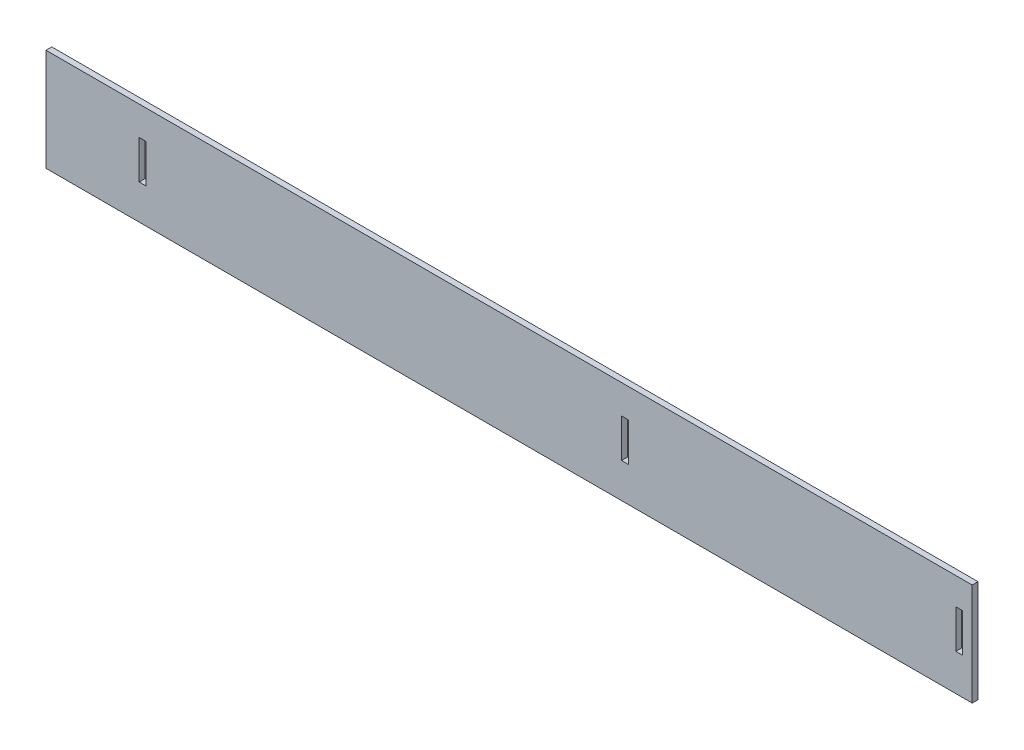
ISO-10303-21;
HEADER;
FILE_DESCRIPTION(('STEP AP214'),'2;1');
FILE_NAME('part.step','',(''),(''),'','','');
FILE_SCHEMA(('AUTOMOTIVE_DESIGN { 1 0 10303 214 1 1 1 1 }'));
ENDSEC;
DATA;
#1=APPLICATION_CONTEXT('core data for automotive mechanical design processes');
#2=APPLICATION_PROTOCOL_DEFINITION('international standard','automotive_design',2000,#1);
#3=PRODUCT_CONTEXT('',#1,'mechanical');
#4=PRODUCT('Part','Part','',(#3));
#5=PRODUCT_RELATED_PRODUCT_CATEGORY('part','',(#4));
#6=PRODUCT_DEFINITION_FORMATION('','',#4);
#7=PRODUCT_DEFINITION_CONTEXT('part definition',#1,'design');
#8=PRODUCT_DEFINITION('design','',#6,#7);
#9=PRODUCT_DEFINITION_SHAPE('','',#8);
#10=(LENGTH_UNIT() NAMED_UNIT(*) SI_UNIT(.MILLI.,.METRE.));
#11=(NAMED_UNIT(*) PLANE_ANGLE_UNIT() SI_UNIT($,.RADIAN.));
#12=(NAMED_UNIT(*) SI_UNIT($,.STERADIAN.) SOLID_ANGLE_UNIT());
#13=UNCERTAINTY_MEASURE_WITH_UNIT(LENGTH_MEASURE(1.E-05),#10,'distance_accuracy_value','');
#14=(GEOMETRIC_REPRESENTATION_CONTEXT(3) GLOBAL_UNCERTAINTY_ASSIGNED_CONTEXT((#13)) GLOBAL_UNIT_ASSIGNED_CONTEXT((#10,
#11,#12)) REPRESENTATION_CONTEXT('',''));
#15=CARTESIAN_POINT('',(0.,0.,0.));
#16=DIRECTION('',(0.,0.,1.));
#17=DIRECTION('',(1.,0.,0.));
#18=AXIS2_PLACEMENT_3D('',#15,#16,#17);
#19=CARTESIAN_POINT('',(0.,0.,3.));
#20=DIRECTION('',(0.,0.,1.));
#21=DIRECTION('',(1.,0.,0.));
#22=AXIS2_PLACEMENT_3D('',#19,#20,#21);
#23=PLANE('',#22);
#24=DIRECTION('',(0.,-1.,0.));
#25=VECTOR('',#24,1.);
#26=CARTESIAN_POINT('',(0.,50.,3.));
#27=LINE('',#26,#25);
#28=CARTESIAN_POINT('',(0.,50.,3.));
#29=VERTEX_POINT('',#28);
#30=CARTESIAN_POINT('',(0.,-3.,3.));
#31=VERTEX_POINT('',#30);
#32=EDGE_CURVE('E244',#29,#31,#27,.T.);
#33=ORIENTED_EDGE('',*,*,#32,.T.);
#34=DIRECTION('',(1.,0.,0.));
#35=VECTOR('',#34,1.);
#36=CARTESIAN_POINT('',(0.,-3.,3.));
#37=LINE('',#36,#35);
#38=CARTESIAN_POINT('',(480.,-3.,3.));
#39=VERTEX_POINT('',#38);
#40=EDGE_CURVE('E246',#31,#39,#37,.T.);
#41=ORIENTED_EDGE('',*,*,#40,.T.);
#42=DIRECTION('',(0.,1.,0.));
#43=VECTOR('',#42,1.);
#44=CARTESIAN_POINT('',(480.,-3.,3.));
#45=LINE('',#44,#43);
#46=CARTESIAN_POINT('',(480.,50.,3.));
#47=VERTEX_POINT('',#46);
#48=EDGE_CURVE('E249',#39,#47,#45,.T.);
#49=ORIENTED_EDGE('',*,*,#48,.T.);
#50=DIRECTION('',(-1.,0.,0.));
#51=VECTOR('',#50,1.);
#52=CARTESIAN_POINT('',(0.,50.,3.));
#53=LINE('',#52,#51);
#54=EDGE_CURVE('E251',#47,#29,#53,.T.);
#55=ORIENTED_EDGE('',*,*,#54,.T.);
#56=EDGE_LOOP('',(#33,#41,#49,#55));
#57=FACE_BOUND('',#56,.T.);
#58=DIRECTION('',(1.,0.,0.));
#59=VECTOR('',#58,1.);
#60=CARTESIAN_POINT('',(48.25,15.,3.));
#61=LINE('',#60,#59);
#62=CARTESIAN_POINT('',(48.25,15.,3.));
#63=VERTEX_POINT('',#62);
#64=CARTESIAN_POINT('',(51.75,15.,3.));
#65=VERTEX_POINT('',#64);
#66=EDGE_CURVE('E215',#63,#65,#61,.T.);
#67=ORIENTED_EDGE('',*,*,#66,.F.);
#68=DIRECTION('',(0.,-1.,0.));
#69=VECTOR('',#68,1.);
#70=CARTESIAN_POINT('',(48.25,35.,3.));
#71=LINE('',#70,#69);
#72=CARTESIAN_POINT('',(48.25,35.,3.));
#73=VERTEX_POINT('',#72);
#74=EDGE_CURVE('E213',#73,#63,#71,.T.);
#75=ORIENTED_EDGE('',*,*,#74,.F.);
#76=DIRECTION('',(-1.,0.,0.));
#77=VECTOR('',#76,1.);
#78=CARTESIAN_POINT('',(48.25,35.,3.));
#79=LINE('',#78,#77);
#80=CARTESIAN_POINT('',(51.75,35.,3.));
#81=VERTEX_POINT('',#80);
#82=EDGE_CURVE('E221',#81,#73,#79,.T.);
#83=ORIENTED_EDGE('',*,*,#82,.F.);
#84=DIRECTION('',(0.,1.,0.));
#85=VECTOR('',#84,1.);
#86=CARTESIAN_POINT('',(51.75,35.,3.));
#87=LINE('',#86,#85);
#88=EDGE_CURVE('E218',#65,#81,#87,.T.);
#89=ORIENTED_EDGE('',*,*,#88,.F.);
#90=EDGE_LOOP('',(#67,#75,#83,#89));
#91=FACE_BOUND('',#90,.T.);
#92=DIRECTION('',(1.,0.,0.));
#93=VECTOR('',#92,1.);
#94=CARTESIAN_POINT('',(298.25,15.,3.));
#95=LINE('',#94,#93);
#96=CARTESIAN_POINT('',(298.25,15.,3.));
#97=VERTEX_POINT('',#96);
#98=CARTESIAN_POINT('',(301.75,15.,3.));
#99=VERTEX_POINT('',#98);
#100=EDGE_CURVE('E184',#97,#99,#95,.T.);
#101=ORIENTED_EDGE('',*,*,#100,.F.);
#102=DIRECTION('',(0.,-1.,0.));
#103=VECTOR('',#102,1.);
#104=CARTESIAN_POINT('',(298.25,35.,3.));
#105=LINE('',#104,#103);
#106=CARTESIAN_POINT('',(298.25,35.,3.));
#107=VERTEX_POINT('',#106);
#108=EDGE_CURVE('E182',#107,#97,#105,.T.);
#109=ORIENTED_EDGE('',*,*,#108,.F.);
#110=DIRECTION('',(-1.,0.,0.));
#111=VECTOR('',#110,1.);
#112=CARTESIAN_POINT('',(298.25,35.,3.));
#113=LINE('',#112,#111);
#114=CARTESIAN_POINT('',(301.75,35.,3.));
#115=VERTEX_POINT('',#114);
#116=EDGE_CURVE('E190',#115,#107,#113,.T.);
#117=ORIENTED_EDGE('',*,*,#116,.F.);
#118=DIRECTION('',(0.,1.,0.));
#119=VECTOR('',#118,1.);
#120=CARTESIAN_POINT('',(301.75,35.,3.));
#121=LINE('',#120,#119);
#122=EDGE_CURVE('E187',#99,#115,#121,.T.);
#123=ORIENTED_EDGE('',*,*,#122,.F.);
#124=EDGE_LOOP('',(#101,#109,#117,#123));
#125=FACE_BOUND('',#124,.T.);
#126=DIRECTION('',(1.,0.,0.));
#127=VECTOR('',#126,1.);
#128=CARTESIAN_POINT('',(471.5,15.9720814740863,3.));
#129=LINE('',#128,#127);
#130=CARTESIAN_POINT('',(471.5,15.9720814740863,3.));
#131=VERTEX_POINT('',#130);
#132=CARTESIAN_POINT('',(475.,15.9720814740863,3.));
#133=VERTEX_POINT('',#132);
#134=EDGE_CURVE('E154',#131,#133,#129,.T.);
#135=ORIENTED_EDGE('',*,*,#134,.F.);
#136=DIRECTION('',(0.,-1.,0.));
#137=VECTOR('',#136,1.);
#138=CARTESIAN_POINT('',(471.5,35.9720814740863,3.));
#139=LINE('',#138,#137);
#140=CARTESIAN_POINT('',(471.5,35.9720814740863,3.));
#141=VERTEX_POINT('',#140);
#142=EDGE_CURVE('E146',#141,#131,#139,.T.);
#143=ORIENTED_EDGE('',*,*,#142,.F.);
#144=DIRECTION('',(-1.,0.,0.));
#145=VECTOR('',#144,1.);
#146=CARTESIAN_POINT('',(471.5,35.9720814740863,3.));
#147=LINE('',#146,#145);
#148=CARTESIAN_POINT('',(475.,35.9720814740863,3.));
#149=VERTEX_POINT('',#148);
#150=EDGE_CURVE('E168',#149,#141,#147,.T.);
#151=ORIENTED_EDGE('',*,*,#150,.F.);
#152=DIRECTION('',(0.,1.,0.));
#153=VECTOR('',#152,1.);
#154=CARTESIAN_POINT('',(475.,35.9720814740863,3.));
#155=LINE('',#154,#153);
#156=EDGE_CURVE('E166',#133,#149,#155,.T.);
#157=ORIENTED_EDGE('',*,*,#156,.F.);
#158=EDGE_LOOP('',(#135,#143,#151,#157));
#159=FACE_BOUND('',#158,.T.);
#160=ADVANCED_FACE('F33',(#57,#91,#125,#159),#23,.T.);
#161=CARTESIAN_POINT('',(0.,0.,0.));
#162=DIRECTION('',(0.,0.,1.));
#163=DIRECTION('',(1.,0.,0.));
#164=AXIS2_PLACEMENT_3D('',#161,#162,#163);
#165=PLANE('',#164);
#166=DIRECTION('',(0.,-1.,0.));
#167=VECTOR('',#166,1.);
#168=CARTESIAN_POINT('',(298.25,35.,0.));
#169=LINE('',#168,#167);
#170=CARTESIAN_POINT('',(298.25,35.,0.));
#171=VERTEX_POINT('',#170);
#172=CARTESIAN_POINT('',(298.25,15.,0.));
#173=VERTEX_POINT('',#172);
#174=EDGE_CURVE('E162',#171,#173,#169,.T.);
#175=ORIENTED_EDGE('',*,*,#174,.T.);
#176=DIRECTION('',(1.,0.,0.));
#177=VECTOR('',#176,1.);
#178=CARTESIAN_POINT('',(298.25,15.,0.));
#179=LINE('',#178,#177);
#180=CARTESIAN_POINT('',(301.75,15.,0.));
#181=VERTEX_POINT('',#180);
#182=EDGE_CURVE('E195',#173,#181,#179,.T.);
#183=ORIENTED_EDGE('',*,*,#182,.T.);
#184=DIRECTION('',(0.,1.,0.));
#185=VECTOR('',#184,1.);
#186=CARTESIAN_POINT('',(301.75,35.,0.));
#187=LINE('',#186,#185);
#188=CARTESIAN_POINT('',(301.75,35.,0.));
#189=VERTEX_POINT('',#188);
#190=EDGE_CURVE('E198',#181,#189,#187,.T.);
#191=ORIENTED_EDGE('',*,*,#190,.T.);
#192=DIRECTION('',(-1.,0.,0.));
#193=VECTOR('',#192,1.);
#194=CARTESIAN_POINT('',(298.25,35.,0.));
#195=LINE('',#194,#193);
#196=EDGE_CURVE('E185',#189,#171,#195,.T.);
#197=ORIENTED_EDGE('',*,*,#196,.T.);
#198=EDGE_LOOP('',(#175,#183,#191,#197));
#199=FACE_BOUND('',#198,.T.);
#200=DIRECTION('',(0.,-1.,0.));
#201=VECTOR('',#200,1.);
#202=CARTESIAN_POINT('',(0.,0.,0.));
#203=LINE('',#202,#201);
#204=CARTESIAN_POINT('',(0.,50.,0.));
#205=VERTEX_POINT('',#204);
#206=CARTESIAN_POINT('',(0.,-3.,0.));
#207=VERTEX_POINT('',#206);
#208=EDGE_CURVE('E243',#205,#207,#203,.T.);
#209=ORIENTED_EDGE('',*,*,#208,.F.);
#210=DIRECTION('',(-1.,0.,0.));
#211=VECTOR('',#210,1.);
#212=CARTESIAN_POINT('',(0.,50.,0.));
#213=LINE('',#212,#211);
#214=CARTESIAN_POINT('',(480.,50.,0.));
#215=VERTEX_POINT('',#214);
#216=EDGE_CURVE('E247',#215,#205,#213,.T.);
#217=ORIENTED_EDGE('',*,*,#216,.F.);
#218=DIRECTION('',(0.,1.,0.));
#219=VECTOR('',#218,1.);
#220=CARTESIAN_POINT('',(480.,-3.,0.));
#221=LINE('',#220,#219);
#222=CARTESIAN_POINT('',(480.,-3.,0.));
#223=VERTEX_POINT('',#222);
#224=EDGE_CURVE('E257',#223,#215,#221,.T.);
#225=ORIENTED_EDGE('',*,*,#224,.F.);
#226=DIRECTION('',(1.,0.,0.));
#227=VECTOR('',#226,1.);
#228=CARTESIAN_POINT('',(0.,-3.,0.));
#229=LINE('',#228,#227);
#230=EDGE_CURVE('E255',#207,#223,#229,.T.);
#231=ORIENTED_EDGE('',*,*,#230,.F.);
#232=EDGE_LOOP('',(#209,#217,#225,#231));
#233=FACE_BOUND('',#232,.T.);
#234=DIRECTION('',(0.,-1.,0.));
#235=VECTOR('',#234,1.);
#236=CARTESIAN_POINT('',(48.25,35.,0.));
#237=LINE('',#236,#235);
#238=CARTESIAN_POINT('',(48.25,35.,0.));
#239=VERTEX_POINT('',#238);
#240=CARTESIAN_POINT('',(48.25,15.,0.));
#241=VERTEX_POINT('',#240);
#242=EDGE_CURVE('E212',#239,#241,#237,.T.);
#243=ORIENTED_EDGE('',*,*,#242,.T.);
#244=DIRECTION('',(1.,0.,0.));
#245=VECTOR('',#244,1.);
#246=CARTESIAN_POINT('',(48.25,15.,0.));
#247=LINE('',#246,#245);
#248=CARTESIAN_POINT('',(51.75,15.,0.));
#249=VERTEX_POINT('',#248);
#250=EDGE_CURVE('E226',#241,#249,#247,.T.);
#251=ORIENTED_EDGE('',*,*,#250,.T.);
#252=DIRECTION('',(0.,1.,0.));
#253=VECTOR('',#252,1.);
#254=CARTESIAN_POINT('',(51.75,35.,0.));
#255=LINE('',#254,#253);
#256=CARTESIAN_POINT('',(51.75,35.,0.));
#257=VERTEX_POINT('',#256);
#258=EDGE_CURVE('E229',#249,#257,#255,.T.);
#259=ORIENTED_EDGE('',*,*,#258,.T.);
#260=DIRECTION('',(-1.,0.,0.));
#261=VECTOR('',#260,1.);
#262=CARTESIAN_POINT('',(48.25,35.,0.));
#263=LINE('',#262,#261);
#264=EDGE_CURVE('E216',#257,#239,#263,.T.);
#265=ORIENTED_EDGE('',*,*,#264,.T.);
#266=EDGE_LOOP('',(#243,#251,#259,#265));
#267=FACE_BOUND('',#266,.T.);
#268=DIRECTION('',(0.,-1.,0.));
#269=VECTOR('',#268,1.);
#270=CARTESIAN_POINT('',(471.5,35.9720814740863,0.));
#271=LINE('',#270,#269);
#272=CARTESIAN_POINT('',(471.5,35.9720814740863,0.));
#273=VERTEX_POINT('',#272);
#274=CARTESIAN_POINT('',(471.5,15.9720814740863,0.));
#275=VERTEX_POINT('',#274);
#276=EDGE_CURVE('E56',#273,#275,#271,.T.);
#277=ORIENTED_EDGE('',*,*,#276,.T.);
#278=DIRECTION('',(1.,0.,0.));
#279=VECTOR('',#278,1.);
#280=CARTESIAN_POINT('',(471.5,15.9720814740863,0.));
#281=LINE('',#280,#279);
#282=CARTESIAN_POINT('',(475.,15.9720814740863,0.));
#283=VERTEX_POINT('',#282);
#284=EDGE_CURVE('E161',#275,#283,#281,.T.);
#285=ORIENTED_EDGE('',*,*,#284,.T.);
#286=DIRECTION('',(0.,1.,0.));
#287=VECTOR('',#286,1.);
#288=CARTESIAN_POINT('',(475.,35.9720814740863,0.));
#289=LINE('',#288,#287);
#290=CARTESIAN_POINT('',(475.,35.9720814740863,0.));
#291=VERTEX_POINT('',#290);
#292=EDGE_CURVE('E174',#283,#291,#289,.T.);
#293=ORIENTED_EDGE('',*,*,#292,.T.);
#294=DIRECTION('',(-1.,0.,0.));
#295=VECTOR('',#294,1.);
#296=CARTESIAN_POINT('',(471.5,35.9720814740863,0.));
#297=LINE('',#296,#295);
#298=EDGE_CURVE('E155',#291,#273,#297,.T.);
#299=ORIENTED_EDGE('',*,*,#298,.T.);
#300=EDGE_LOOP('',(#277,#285,#293,#299));
#301=FACE_BOUND('',#300,.T.);
#302=ADVANCED_FACE('F277',(#199,#233,#267,#301),#165,.F.);
#303=CARTESIAN_POINT('',(0.,0.,3.));
#304=DIRECTION('',(1.,0.,0.));
#305=DIRECTION('',(0.,1.,0.));
#306=AXIS2_PLACEMENT_3D('',#303,#304,#305);
#307=PLANE('',#306);
#308=ORIENTED_EDGE('',*,*,#208,.T.);
#309=DIRECTION('',(0.,0.,-1.));
#310=VECTOR('',#309,1.);
#311=CARTESIAN_POINT('',(0.,-3.,3.));
#312=LINE('',#311,#310);
#313=EDGE_CURVE('E11',#31,#207,#312,.T.);
#314=ORIENTED_EDGE('',*,*,#313,.F.);
#315=ORIENTED_EDGE('',*,*,#32,.F.);
#316=DIRECTION('',(0.,0.,-1.));
#317=VECTOR('',#316,1.);
#318=CARTESIAN_POINT('',(0.,50.,3.));
#319=LINE('',#318,#317);
#320=EDGE_CURVE('E253',#29,#205,#319,.T.);
#321=ORIENTED_EDGE('',*,*,#320,.T.);
#322=EDGE_LOOP('',(#308,#314,#315,#321));
#323=FACE_BOUND('',#322,.T.);
#324=ADVANCED_FACE('F35',(#323),#307,.F.);
#325=CARTESIAN_POINT('',(0.,-3.,3.));
#326=DIRECTION('',(0.,1.,0.));
#327=DIRECTION('',(0.,0.,1.));
#328=AXIS2_PLACEMENT_3D('',#325,#326,#327);
#329=PLANE('',#328);
#330=ORIENTED_EDGE('',*,*,#230,.T.);
#331=DIRECTION('',(0.,0.,-1.));
#332=VECTOR('',#331,1.);
#333=CARTESIAN_POINT('',(480.,-3.,3.));
#334=LINE('',#333,#332);
#335=EDGE_CURVE('E41',#39,#223,#334,.T.);
#336=ORIENTED_EDGE('',*,*,#335,.F.);
#337=ORIENTED_EDGE('',*,*,#40,.F.);
#338=ORIENTED_EDGE('',*,*,#313,.T.);
#339=EDGE_LOOP('',(#330,#336,#337,#338));
#340=FACE_BOUND('',#339,.T.);
#341=ADVANCED_FACE('F288',(#340),#329,.F.);
#342=CARTESIAN_POINT('',(480.,-3.,3.));
#343=DIRECTION('',(-1.,0.,0.));
#344=DIRECTION('',(0.,0.,1.));
#345=AXIS2_PLACEMENT_3D('',#342,#343,#344);
#346=PLANE('',#345);
#347=ORIENTED_EDGE('',*,*,#224,.T.);
#348=DIRECTION('',(0.,0.,-1.));
#349=VECTOR('',#348,1.);
#350=CARTESIAN_POINT('',(480.,50.,3.));
#351=LINE('',#350,#349);
#352=EDGE_CURVE('E263',#47,#215,#351,.T.);
#353=ORIENTED_EDGE('',*,*,#352,.F.);
#354=ORIENTED_EDGE('',*,*,#48,.F.);
#355=ORIENTED_EDGE('',*,*,#335,.T.);
#356=EDGE_LOOP('',(#347,#353,#354,#355));
#357=FACE_BOUND('',#356,.T.);
#358=ADVANCED_FACE('F270',(#357),#346,.F.);
#359=CARTESIAN_POINT('',(0.,50.,3.));
#360=DIRECTION('',(0.,-1.,0.));
#361=DIRECTION('',(1.,0.,0.));
#362=AXIS2_PLACEMENT_3D('',#359,#360,#361);
#363=PLANE('',#362);
#364=ORIENTED_EDGE('',*,*,#216,.T.);
#365=ORIENTED_EDGE('',*,*,#320,.F.);
#366=ORIENTED_EDGE('',*,*,#54,.F.);
#367=ORIENTED_EDGE('',*,*,#352,.T.);
#368=EDGE_LOOP('',(#364,#365,#366,#367));
#369=FACE_BOUND('',#368,.T.);
#370=ADVANCED_FACE('F281',(#369),#363,.F.);
#371=CARTESIAN_POINT('',(48.25,35.,3.));
#372=DIRECTION('',(1.,0.,0.));
#373=DIRECTION('',(0.,0.,-1.));
#374=AXIS2_PLACEMENT_3D('',#371,#372,#373);
#375=PLANE('',#374);
#376=ORIENTED_EDGE('',*,*,#242,.F.);
#377=DIRECTION('',(0.,0.,-1.));
#378=VECTOR('',#377,1.);
#379=CARTESIAN_POINT('',(48.25,35.,3.));
#380=LINE('',#379,#378);
#381=EDGE_CURVE('E223',#73,#239,#380,.T.);
#382=ORIENTED_EDGE('',*,*,#381,.F.);
#383=ORIENTED_EDGE('',*,*,#74,.T.);
#384=DIRECTION('',(0.,0.,-1.));
#385=VECTOR('',#384,1.);
#386=CARTESIAN_POINT('',(48.25,15.,3.));
#387=LINE('',#386,#385);
#388=EDGE_CURVE('E240',#63,#241,#387,.T.);
#389=ORIENTED_EDGE('',*,*,#388,.T.);
#390=EDGE_LOOP('',(#376,#382,#383,#389));
#391=FACE_BOUND('',#390,.T.);
#392=ADVANCED_FACE('F303',(#391),#375,.T.);
#393=CARTESIAN_POINT('',(48.25,15.,3.));
#394=DIRECTION('',(0.,1.,0.));
#395=DIRECTION('',(0.,0.,1.));
#396=AXIS2_PLACEMENT_3D('',#393,#394,#395);
#397=PLANE('',#396);
#398=ORIENTED_EDGE('',*,*,#250,.F.);
#399=ORIENTED_EDGE('',*,*,#388,.F.);
#400=ORIENTED_EDGE('',*,*,#66,.T.);
#401=DIRECTION('',(0.,0.,-1.));
#402=VECTOR('',#401,1.);
#403=CARTESIAN_POINT('',(51.75,15.,3.));
#404=LINE('',#403,#402);
#405=EDGE_CURVE('E238',#65,#249,#404,.T.);
#406=ORIENTED_EDGE('',*,*,#405,.T.);
#407=EDGE_LOOP('',(#398,#399,#400,#406));
#408=FACE_BOUND('',#407,.T.);
#409=ADVANCED_FACE('F310',(#408),#397,.T.);
#410=CARTESIAN_POINT('',(51.75,35.,3.));
#411=DIRECTION('',(-1.,0.,0.));
#412=DIRECTION('',(0.,-1.,0.));
#413=AXIS2_PLACEMENT_3D('',#410,#411,#412);
#414=PLANE('',#413);
#415=ORIENTED_EDGE('',*,*,#258,.F.);
#416=ORIENTED_EDGE('',*,*,#405,.F.);
#417=ORIENTED_EDGE('',*,*,#88,.T.);
#418=DIRECTION('',(0.,0.,-1.));
#419=VECTOR('',#418,1.);
#420=CARTESIAN_POINT('',(51.75,35.,3.));
#421=LINE('',#420,#419);
#422=EDGE_CURVE('E236',#81,#257,#421,.T.);
#423=ORIENTED_EDGE('',*,*,#422,.T.);
#424=EDGE_LOOP('',(#415,#416,#417,#423));
#425=FACE_BOUND('',#424,.T.);
#426=ADVANCED_FACE('F315',(#425),#414,.T.);
#427=CARTESIAN_POINT('',(48.25,35.,3.));
#428=DIRECTION('',(0.,-1.,0.));
#429=DIRECTION('',(0.,0.,-1.));
#430=AXIS2_PLACEMENT_3D('',#427,#428,#429);
#431=PLANE('',#430);
#432=ORIENTED_EDGE('',*,*,#264,.F.);
#433=ORIENTED_EDGE('',*,*,#422,.F.);
#434=ORIENTED_EDGE('',*,*,#82,.T.);
#435=ORIENTED_EDGE('',*,*,#381,.T.);
#436=EDGE_LOOP('',(#432,#433,#434,#435));
#437=FACE_BOUND('',#436,.T.);
#438=ADVANCED_FACE('F322',(#437),#431,.T.);
#439=CARTESIAN_POINT('',(298.25,35.,3.));
#440=DIRECTION('',(1.,0.,0.));
#441=DIRECTION('',(0.,0.,-1.));
#442=AXIS2_PLACEMENT_3D('',#439,#440,#441);
#443=PLANE('',#442);
#444=ORIENTED_EDGE('',*,*,#174,.F.);
#445=DIRECTION('',(0.,0.,-1.));
#446=VECTOR('',#445,1.);
#447=CARTESIAN_POINT('',(298.25,35.,3.));
#448=LINE('',#447,#446);
#449=EDGE_CURVE('E192',#107,#171,#448,.T.);
#450=ORIENTED_EDGE('',*,*,#449,.F.);
#451=ORIENTED_EDGE('',*,*,#108,.T.);
#452=DIRECTION('',(0.,0.,-1.));
#453=VECTOR('',#452,1.);
#454=CARTESIAN_POINT('',(298.25,15.,3.));
#455=LINE('',#454,#453);
#456=EDGE_CURVE('E209',#97,#173,#455,.T.);
#457=ORIENTED_EDGE('',*,*,#456,.T.);
#458=EDGE_LOOP('',(#444,#450,#451,#457));
#459=FACE_BOUND('',#458,.T.);
#460=ADVANCED_FACE('F344',(#459),#443,.T.);
#461=CARTESIAN_POINT('',(298.25,15.,3.));
#462=DIRECTION('',(0.,1.,0.));
#463=DIRECTION('',(0.,0.,1.));
#464=AXIS2_PLACEMENT_3D('',#461,#462,#463);
#465=PLANE('',#464);
#466=ORIENTED_EDGE('',*,*,#182,.F.);
#467=ORIENTED_EDGE('',*,*,#456,.F.);
#468=ORIENTED_EDGE('',*,*,#100,.T.);
#469=DIRECTION('',(0.,0.,-1.));
#470=VECTOR('',#469,1.);
#471=CARTESIAN_POINT('',(301.75,15.,3.));
#472=LINE('',#471,#470);
#473=EDGE_CURVE('E207',#99,#181,#472,.T.);
#474=ORIENTED_EDGE('',*,*,#473,.T.);
#475=EDGE_LOOP('',(#466,#467,#468,#474));
#476=FACE_BOUND('',#475,.T.);
#477=ADVANCED_FACE('F338',(#476),#465,.T.);
#478=CARTESIAN_POINT('',(301.75,35.,3.));
#479=DIRECTION('',(-1.,0.,0.));
#480=DIRECTION('',(0.,0.,1.));
#481=AXIS2_PLACEMENT_3D('',#478,#479,#480);
#482=PLANE('',#481);
#483=ORIENTED_EDGE('',*,*,#190,.F.);
#484=ORIENTED_EDGE('',*,*,#473,.F.);
#485=ORIENTED_EDGE('',*,*,#122,.T.);
#486=DIRECTION('',(0.,0.,-1.));
#487=VECTOR('',#486,1.);
#488=CARTESIAN_POINT('',(301.75,35.,3.));
#489=LINE('',#488,#487);
#490=EDGE_CURVE('E205',#115,#189,#489,.T.);
#491=ORIENTED_EDGE('',*,*,#490,.T.);
#492=EDGE_LOOP('',(#483,#484,#485,#491));
#493=FACE_BOUND('',#492,.T.);
#494=ADVANCED_FACE('F341',(#493),#482,.T.);
#495=CARTESIAN_POINT('',(298.25,35.,3.));
#496=DIRECTION('',(0.,-1.,0.));
#497=DIRECTION('',(0.,0.,-1.));
#498=AXIS2_PLACEMENT_3D('',#495,#496,#497);
#499=PLANE('',#498);
#500=ORIENTED_EDGE('',*,*,#196,.F.);
#501=ORIENTED_EDGE('',*,*,#490,.F.);
#502=ORIENTED_EDGE('',*,*,#116,.T.);
#503=ORIENTED_EDGE('',*,*,#449,.T.);
#504=EDGE_LOOP('',(#500,#501,#502,#503));
#505=FACE_BOUND('',#504,.T.);
#506=ADVANCED_FACE('F347',(#505),#499,.T.);
#507=CARTESIAN_POINT('',(471.5,35.9720814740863,3.));
#508=DIRECTION('',(1.,0.,0.));
#509=DIRECTION('',(0.,0.,-1.));
#510=AXIS2_PLACEMENT_3D('',#507,#508,#509);
#511=PLANE('',#510);
#512=ORIENTED_EDGE('',*,*,#276,.F.);
#513=DIRECTION('',(0.,0.,-1.));
#514=VECTOR('',#513,1.);
#515=CARTESIAN_POINT('',(471.5,35.9720814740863,3.));
#516=LINE('',#515,#514);
#517=EDGE_CURVE('E150',#141,#273,#516,.T.);
#518=ORIENTED_EDGE('',*,*,#517,.F.);
#519=ORIENTED_EDGE('',*,*,#142,.T.);
#520=DIRECTION('',(0.,0.,-1.));
#521=VECTOR('',#520,1.);
#522=CARTESIAN_POINT('',(471.5,15.9720814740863,3.));
#523=LINE('',#522,#521);
#524=EDGE_CURVE('E149',#131,#275,#523,.T.);
#525=ORIENTED_EDGE('',*,*,#524,.T.);
#526=EDGE_LOOP('',(#512,#518,#519,#525));
#527=FACE_BOUND('',#526,.T.);
#528=ADVANCED_FACE('F148',(#527),#511,.T.);
#529=CARTESIAN_POINT('',(471.5,15.9720814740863,3.));
#530=DIRECTION('',(0.,1.,0.));
#531=DIRECTION('',(0.,0.,1.));
#532=AXIS2_PLACEMENT_3D('',#529,#530,#531);
#533=PLANE('',#532);
#534=ORIENTED_EDGE('',*,*,#284,.F.);
#535=ORIENTED_EDGE('',*,*,#524,.F.);
#536=ORIENTED_EDGE('',*,*,#134,.T.);
#537=DIRECTION('',(0.,0.,-1.));
#538=VECTOR('',#537,1.);
#539=CARTESIAN_POINT('',(475.,15.9720814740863,3.));
#540=LINE('',#539,#538);
#541=EDGE_CURVE('E163',#133,#283,#540,.T.);
#542=ORIENTED_EDGE('',*,*,#541,.T.);
#543=EDGE_LOOP('',(#534,#535,#536,#542));
#544=FACE_BOUND('',#543,.T.);
#545=ADVANCED_FACE('F158',(#544),#533,.T.);
#546=CARTESIAN_POINT('',(475.,35.9720814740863,3.));
#547=DIRECTION('',(-1.,0.,0.));
#548=DIRECTION('',(0.,0.,1.));
#549=AXIS2_PLACEMENT_3D('',#546,#547,#548);
#550=PLANE('',#549);
#551=ORIENTED_EDGE('',*,*,#292,.F.);
#552=ORIENTED_EDGE('',*,*,#541,.F.);
#553=ORIENTED_EDGE('',*,*,#156,.T.);
#554=DIRECTION('',(0.,0.,-1.));
#555=VECTOR('',#554,1.);
#556=CARTESIAN_POINT('',(475.,35.9720814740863,3.));
#557=LINE('',#556,#555);
#558=EDGE_CURVE('E48',#149,#291,#557,.T.);
#559=ORIENTED_EDGE('',*,*,#558,.T.);
#560=EDGE_LOOP('',(#551,#552,#553,#559));
#561=FACE_BOUND('',#560,.T.);
#562=ADVANCED_FACE('F404',(#561),#550,.T.);
#563=CARTESIAN_POINT('',(471.5,35.9720814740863,3.));
#564=DIRECTION('',(0.,-1.,0.));
#565=DIRECTION('',(0.,0.,-1.));
#566=AXIS2_PLACEMENT_3D('',#563,#564,#565);
#567=PLANE('',#566);
#568=ORIENTED_EDGE('',*,*,#298,.F.);
#569=ORIENTED_EDGE('',*,*,#558,.F.);
#570=ORIENTED_EDGE('',*,*,#150,.T.);
#571=ORIENTED_EDGE('',*,*,#517,.T.);
#572=EDGE_LOOP('',(#568,#569,#570,#571));
#573=FACE_BOUND('',#572,.T.);
#574=ADVANCED_FACE('F412',(#573),#567,.T.);
#575=CLOSED_SHELL('',(#160,#302,#324,#341,#358,#370,#392,#409,#426,#438,#460,#477,#494,#506,
#528,#545,#562,#574));
#576=MANIFOLD_SOLID_BREP('B2',#575);
#577=ADVANCED_BREP_SHAPE_REPRESENTATION('',(#18,#576),#14);
#578=SHAPE_DEFINITION_REPRESENTATION(#9,#577);
ENDSEC;
END-ISO-10303-21;
